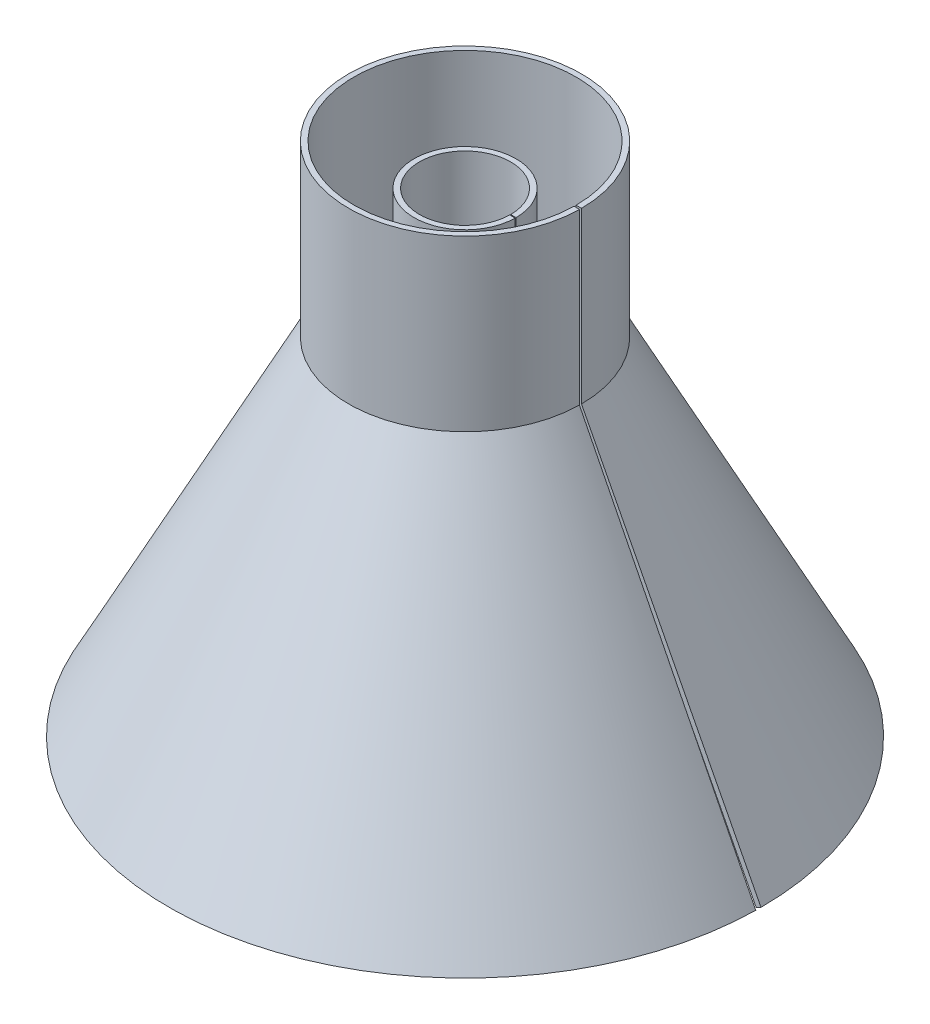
ISO-10303-21;
HEADER;
FILE_DESCRIPTION(('STEP AP214'),'2;1');
FILE_NAME('part.step','',(''),(''),'','','');
FILE_SCHEMA(('AUTOMOTIVE_DESIGN { 1 0 10303 214 1 1 1 1 }'));
ENDSEC;
DATA;
#1=APPLICATION_CONTEXT('core data for automotive mechanical design processes');
#2=APPLICATION_PROTOCOL_DEFINITION('international standard','automotive_design',2000,#1);
#3=PRODUCT_CONTEXT('',#1,'mechanical');
#4=PRODUCT('Part','Part','',(#3));
#5=PRODUCT_RELATED_PRODUCT_CATEGORY('part','',(#4));
#6=PRODUCT_DEFINITION_FORMATION('','',#4);
#7=PRODUCT_DEFINITION_CONTEXT('part definition',#1,'design');
#8=PRODUCT_DEFINITION('design','',#6,#7);
#9=PRODUCT_DEFINITION_SHAPE('','',#8);
#10=(LENGTH_UNIT() NAMED_UNIT(*) SI_UNIT(.MILLI.,.METRE.));
#11=(NAMED_UNIT(*) PLANE_ANGLE_UNIT() SI_UNIT($,.RADIAN.));
#12=(NAMED_UNIT(*) SI_UNIT($,.STERADIAN.) SOLID_ANGLE_UNIT());
#13=UNCERTAINTY_MEASURE_WITH_UNIT(LENGTH_MEASURE(1.E-05),#10,'distance_accuracy_value','');
#14=(GEOMETRIC_REPRESENTATION_CONTEXT(3) GLOBAL_UNCERTAINTY_ASSIGNED_CONTEXT((#13)) GLOBAL_UNIT_ASSIGNED_CONTEXT((#10,
#11,#12)) REPRESENTATION_CONTEXT('',''));
#15=CARTESIAN_POINT('',(0.,0.,0.));
#16=DIRECTION('',(0.,0.,1.));
#17=DIRECTION('',(1.,0.,0.));
#18=AXIS2_PLACEMENT_3D('',#15,#16,#17);
#19=CARTESIAN_POINT('',(0.,0.,0.));
#20=DIRECTION('',(0.,-1.,0.));
#21=DIRECTION('',(0.,0.,-1.));
#22=AXIS2_PLACEMENT_3D('',#19,#20,#21);
#23=CYLINDRICAL_SURFACE('',#22,9.46661613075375);
#24=CARTESIAN_POINT('',(0.,63.7734023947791,0.));
#25=DIRECTION('',(0.,-1.,0.));
#26=DIRECTION('',(0.,0.,-1.));
#27=AXIS2_PLACEMENT_3D('',#24,#25,#26);
#28=CIRCLE('',#27,9.46661613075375);
#29=CARTESIAN_POINT('',(9.46517431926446,63.7734023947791,0.165215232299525));
#30=VERTEX_POINT('',#29);
#31=CARTESIAN_POINT('',(9.46661613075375,63.7734023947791,0.));
#32=VERTEX_POINT('',#31);
#33=EDGE_CURVE('E14',#30,#32,#28,.T.);
#34=ORIENTED_EDGE('',*,*,#33,.F.);
#35=DIRECTION('',(0.,1.,0.));
#36=VECTOR('',#35,1.);
#37=CARTESIAN_POINT('',(9.46517431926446,63.6172817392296,0.165215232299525));
#38=LINE('',#37,#36);
#39=CARTESIAN_POINT('',(9.46517431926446,88.6139579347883,0.165215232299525));
#40=VERTEX_POINT('',#39);
#41=EDGE_CURVE('E116',#30,#40,#38,.T.);
#42=ORIENTED_EDGE('',*,*,#41,.T.);
#43=CARTESIAN_POINT('',(0.,88.6139579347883,0.));
#44=DIRECTION('',(0.,-1.,0.));
#45=DIRECTION('',(0.,0.,-1.));
#46=AXIS2_PLACEMENT_3D('',#43,#44,#45);
#47=CIRCLE('',#46,9.46661613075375);
#48=CARTESIAN_POINT('',(9.46661613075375,88.6139579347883,0.));
#49=VERTEX_POINT('',#48);
#50=EDGE_CURVE('E111',#40,#49,#47,.T.);
#51=ORIENTED_EDGE('',*,*,#50,.T.);
#52=DIRECTION('',(0.,1.,0.));
#53=VECTOR('',#52,1.);
#54=CARTESIAN_POINT('',(9.46661613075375,63.6172817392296,0.));
#55=LINE('',#54,#53);
#56=EDGE_CURVE('E114',#32,#49,#55,.T.);
#57=ORIENTED_EDGE('',*,*,#56,.F.);
#58=EDGE_LOOP('',(#34,#42,#51,#57));
#59=FACE_BOUND('',#58,.T.);
#60=ADVANCED_FACE('F63',(#59),#23,.T.);
#61=CARTESIAN_POINT('',(0.,0.304811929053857,0.));
#62=DIRECTION('',(0.,-1.,0.));
#63=DIRECTION('',(0.,0.,-1.));
#64=AXIS2_PLACEMENT_3D('',#61,#62,#63);
#65=CONICAL_SURFACE('',#64,29.7792246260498,0.309740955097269);
#66=CARTESIAN_POINT('',(0.,0.304811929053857,0.));
#67=DIRECTION('',(0.,-1.,0.));
#68=DIRECTION('',(0.,0.,-1.));
#69=AXIS2_PLACEMENT_3D('',#66,#67,#68);
#70=CIRCLE('',#69,29.7792246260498);
#71=CARTESIAN_POINT('',(29.7746891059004,0.304811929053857,0.519719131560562));
#72=VERTEX_POINT('',#71);
#73=CARTESIAN_POINT('',(29.7792246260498,0.304811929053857,0.));
#74=VERTEX_POINT('',#73);
#75=EDGE_CURVE('E71',#72,#74,#70,.T.);
#76=ORIENTED_EDGE('',*,*,#75,.F.);
#77=DIRECTION('',(-0.304765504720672,0.952412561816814,-0.00531970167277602));
#78=VECTOR('',#77,1.);
#79=CARTESIAN_POINT('',(29.7746891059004,0.304811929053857,0.519719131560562));
#80=LINE('',#79,#78);
#81=EDGE_CURVE('E121',#72,#30,#80,.T.);
#82=ORIENTED_EDGE('',*,*,#81,.T.);
#83=ORIENTED_EDGE('',*,*,#33,.T.);
#84=DIRECTION('',(-0.304811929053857,0.952412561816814,0.));
#85=VECTOR('',#84,1.);
#86=CARTESIAN_POINT('',(29.7792246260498,0.304811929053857,0.));
#87=LINE('',#86,#85);
#88=EDGE_CURVE('E134',#74,#32,#87,.T.);
#89=ORIENTED_EDGE('',*,*,#88,.F.);
#90=EDGE_LOOP('',(#76,#82,#83,#89));
#91=FACE_BOUND('',#90,.T.);
#92=ADVANCED_FACE('F65',(#91),#65,.T.);
#93=CARTESIAN_POINT('',(0.,0.304811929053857,0.));
#94=DIRECTION('',(0.,1.,0.));
#95=DIRECTION('',(0.,0.,1.));
#96=AXIS2_PLACEMENT_3D('',#93,#94,#95);
#97=CONICAL_SURFACE('',#96,29.7792246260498,1.26105537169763);
#98=CARTESIAN_POINT('',(0.,0.,0.));
#99=DIRECTION('',(0.,-1.,0.));
#100=DIRECTION('',(0.,0.,-1.));
#101=AXIS2_PLACEMENT_3D('',#98,#99,#100);
#102=CIRCLE('',#101,28.826812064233);
#103=CARTESIAN_POINT('',(28.8224216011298,0.,0.503097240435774));
#104=VERTEX_POINT('',#103);
#105=CARTESIAN_POINT('',(28.826812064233,0.,0.));
#106=VERTEX_POINT('',#105);
#107=EDGE_CURVE('E161',#104,#106,#102,.T.);
#108=ORIENTED_EDGE('',*,*,#107,.F.);
#109=DIRECTION('',(-0.952267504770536,-0.304811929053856,-0.016621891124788));
#110=VECTOR('',#109,1.);
#111=CARTESIAN_POINT('',(29.7746891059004,0.304811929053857,0.519719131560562));
#112=LINE('',#111,#110);
#113=EDGE_CURVE('E154',#72,#104,#112,.T.);
#114=ORIENTED_EDGE('',*,*,#113,.F.);
#115=ORIENTED_EDGE('',*,*,#75,.T.);
#116=DIRECTION('',(-0.952412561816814,-0.304811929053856,0.));
#117=VECTOR('',#116,1.);
#118=CARTESIAN_POINT('',(29.7792246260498,0.304811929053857,0.));
#119=LINE('',#118,#117);
#120=EDGE_CURVE('E141',#74,#106,#119,.T.);
#121=ORIENTED_EDGE('',*,*,#120,.T.);
#122=EDGE_LOOP('',(#108,#114,#115,#121));
#123=FACE_BOUND('',#122,.T.);
#124=ADVANCED_FACE('F163',(#123),#97,.T.);
#125=CARTESIAN_POINT('',(0.,0.,0.));
#126=DIRECTION('',(0.,-1.,0.));
#127=DIRECTION('',(0.,0.,-1.));
#128=AXIS2_PLACEMENT_3D('',#125,#126,#127);
#129=CONICAL_SURFACE('',#128,28.826812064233,0.309740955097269);
#130=CARTESIAN_POINT('',(0.,63.6172817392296,0.));
#131=DIRECTION('',(0.,-1.,0.));
#132=DIRECTION('',(0.,0.,-1.));
#133=AXIS2_PLACEMENT_3D('',#130,#131,#132);
#134=CIRCLE('',#133,8.46661613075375);
#135=CARTESIAN_POINT('',(8.46532662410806,63.6172817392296,0.147762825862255));
#136=VERTEX_POINT('',#135);
#137=CARTESIAN_POINT('',(8.46661613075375,63.6172817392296,0.));
#138=VERTEX_POINT('',#137);
#139=EDGE_CURVE('E159',#136,#138,#134,.T.);
#140=ORIENTED_EDGE('',*,*,#139,.F.);
#141=DIRECTION('',(-0.304765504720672,0.952412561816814,-0.00531970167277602));
#142=VECTOR('',#141,1.);
#143=CARTESIAN_POINT('',(28.8224216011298,0.,0.503097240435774));
#144=LINE('',#143,#142);
#145=EDGE_CURVE('E151',#104,#136,#144,.T.);
#146=ORIENTED_EDGE('',*,*,#145,.F.);
#147=ORIENTED_EDGE('',*,*,#107,.T.);
#148=DIRECTION('',(-0.304811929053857,0.952412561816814,0.));
#149=VECTOR('',#148,1.);
#150=CARTESIAN_POINT('',(28.826812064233,0.,0.));
#151=LINE('',#150,#149);
#152=EDGE_CURVE('E138',#106,#138,#151,.T.);
#153=ORIENTED_EDGE('',*,*,#152,.T.);
#154=EDGE_LOOP('',(#140,#146,#147,#153));
#155=FACE_BOUND('',#154,.T.);
#156=ADVANCED_FACE('F173',(#155),#129,.F.);
#157=CARTESIAN_POINT('',(0.,0.,0.));
#158=DIRECTION('',(0.,-1.,0.));
#159=DIRECTION('',(0.,0.,-1.));
#160=AXIS2_PLACEMENT_3D('',#157,#158,#159);
#161=CYLINDRICAL_SURFACE('',#160,8.46661613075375);
#162=CARTESIAN_POINT('',(0.,88.6139579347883,0.));
#163=DIRECTION('',(0.,-1.,0.));
#164=DIRECTION('',(0.,0.,-1.));
#165=AXIS2_PLACEMENT_3D('',#162,#163,#164);
#166=CIRCLE('',#165,8.46661613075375);
#167=CARTESIAN_POINT('',(8.46532662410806,88.6139579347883,0.147762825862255));
#168=VERTEX_POINT('',#167);
#169=CARTESIAN_POINT('',(8.46661613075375,88.6139579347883,0.));
#170=VERTEX_POINT('',#169);
#171=EDGE_CURVE('E120',#168,#170,#166,.T.);
#172=ORIENTED_EDGE('',*,*,#171,.F.);
#173=DIRECTION('',(0.,1.,0.));
#174=VECTOR('',#173,1.);
#175=CARTESIAN_POINT('',(8.46532662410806,63.6172817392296,0.147762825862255));
#176=LINE('',#175,#174);
#177=EDGE_CURVE('E148',#136,#168,#176,.T.);
#178=ORIENTED_EDGE('',*,*,#177,.F.);
#179=ORIENTED_EDGE('',*,*,#139,.T.);
#180=DIRECTION('',(0.,1.,0.));
#181=VECTOR('',#180,1.);
#182=CARTESIAN_POINT('',(8.46661613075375,63.6172817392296,0.));
#183=LINE('',#182,#181);
#184=EDGE_CURVE('E129',#138,#170,#183,.T.);
#185=ORIENTED_EDGE('',*,*,#184,.T.);
#186=EDGE_LOOP('',(#172,#178,#179,#185));
#187=FACE_BOUND('',#186,.T.);
#188=ADVANCED_FACE('F171',(#187),#161,.F.);
#189=CARTESIAN_POINT('',(8.46532662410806,88.6139579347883,0.147762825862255));
#190=DIRECTION('',(0.,-1.,0.));
#191=DIRECTION('',(0.,0.,-1.));
#192=AXIS2_PLACEMENT_3D('',#189,#190,#191);
#193=PLANE('',#192);
#194=DIRECTION('',(0.999847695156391,0.,0.0174524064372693));
#195=VECTOR('',#194,1.);
#196=CARTESIAN_POINT('',(8.46532662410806,88.6139579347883,0.147762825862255));
#197=LINE('',#196,#195);
#198=EDGE_CURVE('E146',#168,#40,#197,.T.);
#199=ORIENTED_EDGE('',*,*,#198,.F.);
#200=ORIENTED_EDGE('',*,*,#171,.T.);
#201=DIRECTION('',(1.,0.,0.));
#202=VECTOR('',#201,1.);
#203=CARTESIAN_POINT('',(8.46661613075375,88.6139579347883,0.));
#204=LINE('',#203,#202);
#205=EDGE_CURVE('E124',#170,#49,#204,.T.);
#206=ORIENTED_EDGE('',*,*,#205,.T.);
#207=ORIENTED_EDGE('',*,*,#50,.F.);
#208=EDGE_LOOP('',(#199,#200,#206,#207));
#209=FACE_BOUND('',#208,.T.);
#210=ADVANCED_FACE('F125',(#209),#193,.F.);
#211=CARTESIAN_POINT('',(0.,0.,0.));
#212=DIRECTION('',(0.0174524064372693,0.,-0.999847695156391));
#213=DIRECTION('',(-0.999847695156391,0.,-0.0174524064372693));
#214=AXIS2_PLACEMENT_3D('',#211,#212,#213);
#215=PLANE('',#214);
#216=ORIENTED_EDGE('',*,*,#41,.F.);
#217=ORIENTED_EDGE('',*,*,#81,.F.);
#218=ORIENTED_EDGE('',*,*,#113,.T.);
#219=ORIENTED_EDGE('',*,*,#145,.T.);
#220=ORIENTED_EDGE('',*,*,#177,.T.);
#221=ORIENTED_EDGE('',*,*,#198,.T.);
#222=EDGE_LOOP('',(#216,#217,#218,#219,#220,#221));
#223=FACE_BOUND('',#222,.T.);
#224=ADVANCED_FACE('F167',(#223),#215,.T.);
#225=CARTESIAN_POINT('',(0.,0.,0.));
#226=DIRECTION('',(0.,0.,-1.));
#227=DIRECTION('',(-1.,0.,0.));
#228=AXIS2_PLACEMENT_3D('',#225,#226,#227);
#229=PLANE('',#228);
#230=ORIENTED_EDGE('',*,*,#56,.T.);
#231=ORIENTED_EDGE('',*,*,#205,.F.);
#232=ORIENTED_EDGE('',*,*,#184,.F.);
#233=ORIENTED_EDGE('',*,*,#152,.F.);
#234=ORIENTED_EDGE('',*,*,#120,.F.);
#235=ORIENTED_EDGE('',*,*,#88,.T.);
#236=EDGE_LOOP('',(#230,#231,#232,#233,#234,#235));
#237=FACE_BOUND('',#236,.T.);
#238=ADVANCED_FACE('F132',(#237),#229,.F.);
#239=CLOSED_SHELL('',(#60,#92,#124,#156,#188,#210,#224,#238));
#240=MANIFOLD_SOLID_BREP('B2',#239);
#241=CARTESIAN_POINT('',(0.,0.,0.));
#242=DIRECTION('',(0.,-1.,0.));
#243=DIRECTION('',(0.,0.,-1.));
#244=AXIS2_PLACEMENT_3D('',#241,#242,#243);
#245=CYLINDRICAL_SURFACE('',#244,21.6235946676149);
#246=CARTESIAN_POINT('',(0.,64.7297354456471,0.));
#247=DIRECTION('',(0.,-1.,0.));
#248=DIRECTION('',(0.,0.,-1.));
#249=AXIS2_PLACEMENT_3D('',#246,#247,#248);
#250=CIRCLE('',#249,21.6235946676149);
#251=CARTESIAN_POINT('',(21.6203012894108,64.7297354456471,0.377383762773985));
#252=VERTEX_POINT('',#251);
#253=CARTESIAN_POINT('',(21.6235946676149,64.7297354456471,0.));
#254=VERTEX_POINT('',#253);
#255=EDGE_CURVE('E61',#252,#254,#250,.T.);
#256=ORIENTED_EDGE('',*,*,#255,.F.);
#257=DIRECTION('',(0.,1.,0.));
#258=VECTOR('',#257,1.);
#259=CARTESIAN_POINT('',(21.6203012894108,64.485913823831,0.377383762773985));
#260=LINE('',#259,#258);
#261=CARTESIAN_POINT('',(21.6203012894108,96.1903043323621,0.377383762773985));
#262=VERTEX_POINT('',#261);
#263=EDGE_CURVE('E298',#252,#262,#260,.T.);
#264=ORIENTED_EDGE('',*,*,#263,.T.);
#265=CARTESIAN_POINT('',(0.,96.1903043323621,0.));
#266=DIRECTION('',(0.,-1.,0.));
#267=DIRECTION('',(0.,0.,-1.));
#268=AXIS2_PLACEMENT_3D('',#265,#266,#267);
#269=CIRCLE('',#268,21.6235946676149);
#270=CARTESIAN_POINT('',(21.6235946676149,96.1903043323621,0.));
#271=VERTEX_POINT('',#270);
#272=EDGE_CURVE('E293',#262,#271,#269,.T.);
#273=ORIENTED_EDGE('',*,*,#272,.T.);
#274=DIRECTION('',(0.,1.,0.));
#275=VECTOR('',#274,1.);
#276=CARTESIAN_POINT('',(21.6235946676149,64.485913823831,0.));
#277=LINE('',#276,#275);
#278=EDGE_CURVE('E296',#254,#271,#277,.T.);
#279=ORIENTED_EDGE('',*,*,#278,.F.);
#280=EDGE_LOOP('',(#256,#264,#273,#279));
#281=FACE_BOUND('',#280,.T.);
#282=ADVANCED_FACE('F245',(#281),#245,.T.);
#283=CARTESIAN_POINT('',(0.,0.460280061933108,0.));
#284=DIRECTION('',(0.,-1.,0.));
#285=DIRECTION('',(0.,0.,-1.));
#286=AXIS2_PLACEMENT_3D('',#283,#284,#285);
#287=CONICAL_SURFACE('',#286,54.9450893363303,0.478310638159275);
#288=CARTESIAN_POINT('',(0.,0.460280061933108,0.));
#289=DIRECTION('',(0.,-1.,0.));
#290=DIRECTION('',(0.,0.,-1.));
#291=AXIS2_PLACEMENT_3D('',#288,#289,#290);
#292=CIRCLE('',#291,54.9450893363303);
#293=CARTESIAN_POINT('',(54.9367209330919,0.460280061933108,0.958924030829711));
#294=VERTEX_POINT('',#293);
#295=CARTESIAN_POINT('',(54.9450893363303,0.460280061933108,0.));
#296=VERTEX_POINT('',#295);
#297=EDGE_CURVE('E253',#294,#296,#292,.T.);
#298=ORIENTED_EDGE('',*,*,#297,.F.);
#299=DIRECTION('',(-0.46020995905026,0.887773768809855,-0.00803299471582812));
#300=VECTOR('',#299,1.);
#301=CARTESIAN_POINT('',(54.9367209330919,0.460280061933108,0.958924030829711));
#302=LINE('',#301,#300);
#303=EDGE_CURVE('E303',#294,#252,#302,.T.);
#304=ORIENTED_EDGE('',*,*,#303,.T.);
#305=ORIENTED_EDGE('',*,*,#255,.T.);
#306=DIRECTION('',(-0.460280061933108,0.887773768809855,0.));
#307=VECTOR('',#306,1.);
#308=CARTESIAN_POINT('',(54.9450893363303,0.460280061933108,0.));
#309=LINE('',#308,#307);
#310=EDGE_CURVE('E316',#296,#254,#309,.T.);
#311=ORIENTED_EDGE('',*,*,#310,.F.);
#312=EDGE_LOOP('',(#298,#304,#305,#311));
#313=FACE_BOUND('',#312,.T.);
#314=ADVANCED_FACE('F247',(#313),#287,.T.);
#315=CARTESIAN_POINT('',(0.,0.460280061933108,0.));
#316=DIRECTION('',(0.,1.,0.));
#317=DIRECTION('',(0.,0.,1.));
#318=AXIS2_PLACEMENT_3D('',#315,#316,#317);
#319=CONICAL_SURFACE('',#318,54.9450893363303,1.09248568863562);
#320=CARTESIAN_POINT('',(0.,0.,0.));
#321=DIRECTION('',(0.,-1.,0.));
#322=DIRECTION('',(0.,0.,-1.));
#323=AXIS2_PLACEMENT_3D('',#320,#321,#322);
#324=CIRCLE('',#323,54.0573155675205);
#325=CARTESIAN_POINT('',(54.0490823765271,0.,0.943430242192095));
#326=VERTEX_POINT('',#325);
#327=CARTESIAN_POINT('',(54.0573155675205,0.,0.));
#328=VERTEX_POINT('',#327);
#329=EDGE_CURVE('E343',#326,#328,#324,.T.);
#330=ORIENTED_EDGE('',*,*,#329,.F.);
#331=DIRECTION('',(-0.887638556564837,-0.460280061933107,-0.015493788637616));
#332=VECTOR('',#331,1.);
#333=CARTESIAN_POINT('',(54.9367209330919,0.460280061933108,0.958924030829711));
#334=LINE('',#333,#332);
#335=EDGE_CURVE('E336',#294,#326,#334,.T.);
#336=ORIENTED_EDGE('',*,*,#335,.F.);
#337=ORIENTED_EDGE('',*,*,#297,.T.);
#338=DIRECTION('',(-0.887773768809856,-0.460280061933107,0.));
#339=VECTOR('',#338,1.);
#340=CARTESIAN_POINT('',(54.9450893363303,0.460280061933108,0.));
#341=LINE('',#340,#339);
#342=EDGE_CURVE('E323',#296,#328,#341,.T.);
#343=ORIENTED_EDGE('',*,*,#342,.T.);
#344=EDGE_LOOP('',(#330,#336,#337,#343));
#345=FACE_BOUND('',#344,.T.);
#346=ADVANCED_FACE('F345',(#345),#319,.T.);
#347=CARTESIAN_POINT('',(0.,0.,0.));
#348=DIRECTION('',(0.,-1.,0.));
#349=DIRECTION('',(0.,0.,-1.));
#350=AXIS2_PLACEMENT_3D('',#347,#348,#349);
#351=CONICAL_SURFACE('',#350,54.0573155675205,0.478310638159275);
#352=CARTESIAN_POINT('',(0.,64.485913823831,0.));
#353=DIRECTION('',(0.,-1.,0.));
#354=DIRECTION('',(0.,0.,-1.));
#355=AXIS2_PLACEMENT_3D('',#352,#353,#354);
#356=CIRCLE('',#355,20.6235946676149);
#357=CARTESIAN_POINT('',(20.6204535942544,64.485913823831,0.359931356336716));
#358=VERTEX_POINT('',#357);
#359=CARTESIAN_POINT('',(20.6235946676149,64.485913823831,0.));
#360=VERTEX_POINT('',#359);
#361=EDGE_CURVE('E341',#358,#360,#356,.T.);
#362=ORIENTED_EDGE('',*,*,#361,.F.);
#363=DIRECTION('',(-0.46020995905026,0.887773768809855,-0.00803299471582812));
#364=VECTOR('',#363,1.);
#365=CARTESIAN_POINT('',(54.0490823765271,0.,0.943430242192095));
#366=LINE('',#365,#364);
#367=EDGE_CURVE('E333',#326,#358,#366,.T.);
#368=ORIENTED_EDGE('',*,*,#367,.F.);
#369=ORIENTED_EDGE('',*,*,#329,.T.);
#370=DIRECTION('',(-0.460280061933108,0.887773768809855,0.));
#371=VECTOR('',#370,1.);
#372=CARTESIAN_POINT('',(54.0573155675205,0.,0.));
#373=LINE('',#372,#371);
#374=EDGE_CURVE('E320',#328,#360,#373,.T.);
#375=ORIENTED_EDGE('',*,*,#374,.T.);
#376=EDGE_LOOP('',(#362,#368,#369,#375));
#377=FACE_BOUND('',#376,.T.);
#378=ADVANCED_FACE('F355',(#377),#351,.F.);
#379=CARTESIAN_POINT('',(0.,0.,0.));
#380=DIRECTION('',(0.,-1.,0.));
#381=DIRECTION('',(0.,0.,-1.));
#382=AXIS2_PLACEMENT_3D('',#379,#380,#381);
#383=CYLINDRICAL_SURFACE('',#382,20.6235946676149);
#384=CARTESIAN_POINT('',(0.,96.1903043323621,0.));
#385=DIRECTION('',(0.,-1.,0.));
#386=DIRECTION('',(0.,0.,-1.));
#387=AXIS2_PLACEMENT_3D('',#384,#385,#386);
#388=CIRCLE('',#387,20.6235946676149);
#389=CARTESIAN_POINT('',(20.6204535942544,96.1903043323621,0.359931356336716));
#390=VERTEX_POINT('',#389);
#391=CARTESIAN_POINT('',(20.6235946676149,96.1903043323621,0.));
#392=VERTEX_POINT('',#391);
#393=EDGE_CURVE('E302',#390,#392,#388,.T.);
#394=ORIENTED_EDGE('',*,*,#393,.F.);
#395=DIRECTION('',(0.,1.,0.));
#396=VECTOR('',#395,1.);
#397=CARTESIAN_POINT('',(20.6204535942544,64.485913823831,0.359931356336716));
#398=LINE('',#397,#396);
#399=EDGE_CURVE('E330',#358,#390,#398,.T.);
#400=ORIENTED_EDGE('',*,*,#399,.F.);
#401=ORIENTED_EDGE('',*,*,#361,.T.);
#402=DIRECTION('',(0.,1.,0.));
#403=VECTOR('',#402,1.);
#404=CARTESIAN_POINT('',(20.6235946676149,64.485913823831,0.));
#405=LINE('',#404,#403);
#406=EDGE_CURVE('E311',#360,#392,#405,.T.);
#407=ORIENTED_EDGE('',*,*,#406,.T.);
#408=EDGE_LOOP('',(#394,#400,#401,#407));
#409=FACE_BOUND('',#408,.T.);
#410=ADVANCED_FACE('F353',(#409),#383,.F.);
#411=CARTESIAN_POINT('',(20.6204535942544,96.1903043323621,0.359931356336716));
#412=DIRECTION('',(0.,-1.,0.));
#413=DIRECTION('',(0.,0.,-1.));
#414=AXIS2_PLACEMENT_3D('',#411,#412,#413);
#415=PLANE('',#414);
#416=DIRECTION('',(0.999847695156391,0.,0.0174524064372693));
#417=VECTOR('',#416,1.);
#418=CARTESIAN_POINT('',(20.6204535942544,96.1903043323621,0.359931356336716));
#419=LINE('',#418,#417);
#420=EDGE_CURVE('E328',#390,#262,#419,.T.);
#421=ORIENTED_EDGE('',*,*,#420,.F.);
#422=ORIENTED_EDGE('',*,*,#393,.T.);
#423=DIRECTION('',(1.,0.,0.));
#424=VECTOR('',#423,1.);
#425=CARTESIAN_POINT('',(20.6235946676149,96.1903043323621,0.));
#426=LINE('',#425,#424);
#427=EDGE_CURVE('E306',#392,#271,#426,.T.);
#428=ORIENTED_EDGE('',*,*,#427,.T.);
#429=ORIENTED_EDGE('',*,*,#272,.F.);
#430=EDGE_LOOP('',(#421,#422,#428,#429));
#431=FACE_BOUND('',#430,.T.);
#432=ADVANCED_FACE('F307',(#431),#415,.F.);
#433=CARTESIAN_POINT('',(0.,0.,0.));
#434=DIRECTION('',(0.0174524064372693,0.,-0.999847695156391));
#435=DIRECTION('',(-0.999847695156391,0.,-0.0174524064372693));
#436=AXIS2_PLACEMENT_3D('',#433,#434,#435);
#437=PLANE('',#436);
#438=ORIENTED_EDGE('',*,*,#263,.F.);
#439=ORIENTED_EDGE('',*,*,#303,.F.);
#440=ORIENTED_EDGE('',*,*,#335,.T.);
#441=ORIENTED_EDGE('',*,*,#367,.T.);
#442=ORIENTED_EDGE('',*,*,#399,.T.);
#443=ORIENTED_EDGE('',*,*,#420,.T.);
#444=EDGE_LOOP('',(#438,#439,#440,#441,#442,#443));
#445=FACE_BOUND('',#444,.T.);
#446=ADVANCED_FACE('F349',(#445),#437,.T.);
#447=CARTESIAN_POINT('',(0.,0.,0.));
#448=DIRECTION('',(0.,0.,-1.));
#449=DIRECTION('',(-1.,0.,0.));
#450=AXIS2_PLACEMENT_3D('',#447,#448,#449);
#451=PLANE('',#450);
#452=ORIENTED_EDGE('',*,*,#278,.T.);
#453=ORIENTED_EDGE('',*,*,#427,.F.);
#454=ORIENTED_EDGE('',*,*,#406,.F.);
#455=ORIENTED_EDGE('',*,*,#374,.F.);
#456=ORIENTED_EDGE('',*,*,#342,.F.);
#457=ORIENTED_EDGE('',*,*,#310,.T.);
#458=EDGE_LOOP('',(#452,#453,#454,#455,#456,#457));
#459=FACE_BOUND('',#458,.T.);
#460=ADVANCED_FACE('F314',(#459),#451,.F.);
#461=CLOSED_SHELL('',(#282,#314,#346,#378,#410,#432,#446,#460));
#462=MANIFOLD_SOLID_BREP('B8_NOT_SHOWN',#461);
#463=ADVANCED_BREP_SHAPE_REPRESENTATION('',(#18,#240,#462),#14);
#464=SHAPE_DEFINITION_REPRESENTATION(#9,#463);
ENDSEC;
END-ISO-10303-21;
